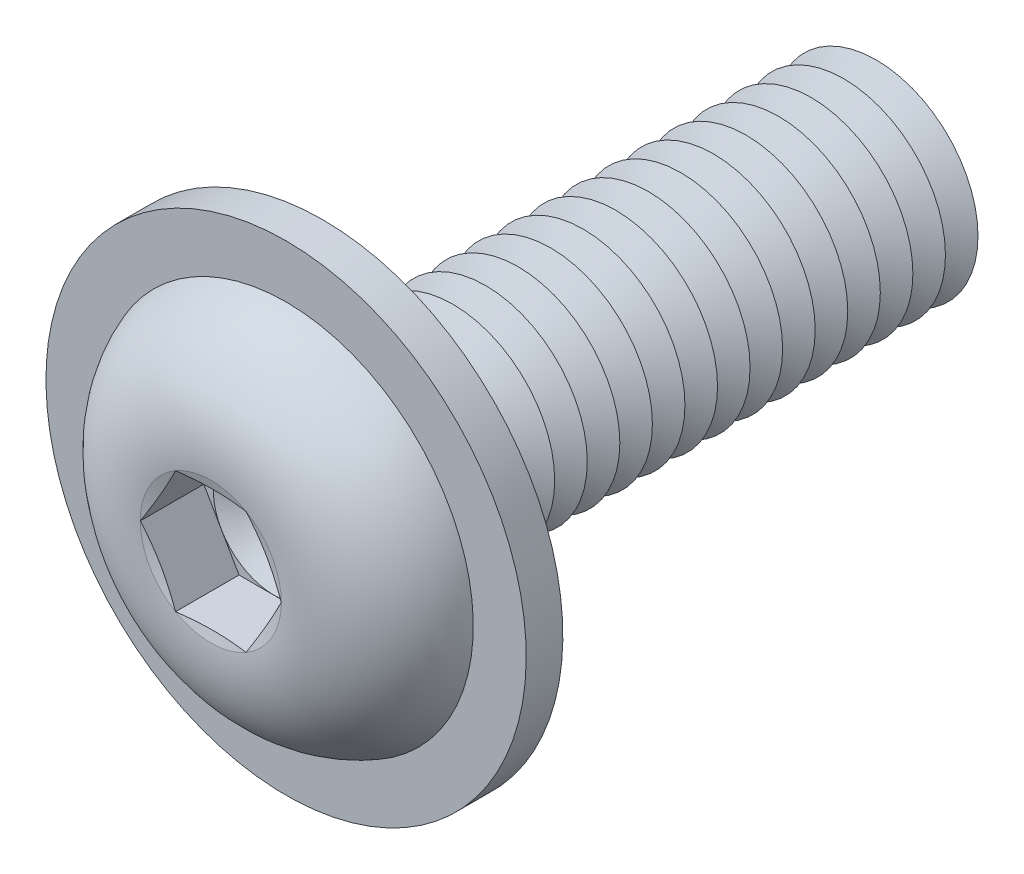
from build123d import *

# Parameters (mm, degrees)
FILLET1_R           = 0.4
LPATTERN1_COUNT     = 17
LPATTERN1_PITCH     = 0.8
CUT_EXTRUDE1_DEPTH  = 1.56
SKETCH5_R           = 5.9
SKETCH5_R_2         = 2.9
BOSS_EXTRUDE1_DEPTH = 0.9


with BuildPart() as part:
    # Sketch1 → Revolve1 (revolve)
    with BuildSketch(Plane(origin=(0, 0, 0), x_dir=(0, 0, -1), z_dir=(1, 0, 0)), mode=Mode.PRIVATE) as revolve1_sk:
        with BuildLine():
            Line((0, 2.5), (0, 4.75))
            ThreePointArc((0, 4.75), (-2.041477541, 3.848329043), (-2.75, 1.73205))
            Line((-2.75, 1.73205), (-2.517949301, 0.866025))
            Line((-2.517949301, 0.866025), (-2.75, 0.866025))
            Line((-2.75, 0.866025), (-2.75, 0))
            Line((-2.75, 0), (14, 0))
            Line((14, 0), (14, 2.5))
            Line((14, 2.5), (0, 2.5))
        make_face()
    revolve(revolve1_sk.sketch.rotate(Axis((0, 0, -14), (0, 0, 1)), 90), axis=Axis((0, 0, -14), (0, 0, 1)))

    # Fillet1
    fillet1_edges = [part.edges().sort_by_distance(p)[0] for p in [
        (2.5, 0, 0),
    ]]
    fillet(fillet1_edges, radius=FILLET1_R)

    # Sketch2 → Cut-Revolve1 (revolve, cut)
    with BuildSketch(Plane(origin=(0, 0, 0), x_dir=(0, 0, -1), z_dir=(1, 0, 0)), mode=Mode.PRIVATE) as cut_revolve1_sk:
        Polygon((13.6, 2.5), (14.4, 2.5), (14, 1.807179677), align=None)
    cut_revolve1 = revolve(cut_revolve1_sk.sketch.rotate(Axis((0, 0, -14), (0, 0, -1)), 270), axis=Axis((0, 0, -14), (0, 0, -1)), mode=Mode.SUBTRACT)

    # LPattern1: Cut-Revolve1 ×17
    with Locations(*[(0, 0, i * LPATTERN1_PITCH) for i in range(1, LPATTERN1_COUNT)]):
        add(cut_revolve1, mode=Mode.SUBTRACT)

    # Sketch3 → Cut-Extrude1 (cut)
    with BuildSketch(Plane.XY.offset(2.75)):
        Polygon((0.866025, 1.499999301), (-0.866025, 1.499999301), (-1.73205, 0), (-0.866025, -1.499999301), (0.866025, -1.499999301), (1.73205, 0), align=None)
    extrude(amount=-CUT_EXTRUDE1_DEPTH, mode=Mode.SUBTRACT)

    # Cut-Extrude2 cone 1 section (on through the dimple's axis) → Cut-Extrude2 (revolve, cut)
    with BuildSketch(Plane(origin=(0, 0, 1.19), x_dir=(0, -1, 0), z_dir=(1, 0, 0))):
        Polygon((0, 0), (1.499999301, 0), (0, 0.866025), align=None)
    revolve(axis=Axis((0, 0, 1.19), (0, 0, -1)), mode=Mode.SUBTRACT)

    # Sketch5 → Boss-Extrude1 (add)
    with BuildSketch(Plane(origin=(0, 0, 0), x_dir=(-1, 0, 0), z_dir=(0, 0, -1))):
        with Locations(Location((0, 0, 0), (0, 0, 90))):
            Circle(SKETCH5_R)
        Circle(SKETCH5_R_2, mode=Mode.SUBTRACT)
    extrude(amount=-BOSS_EXTRUDE1_DEPTH)


solid = part.part
